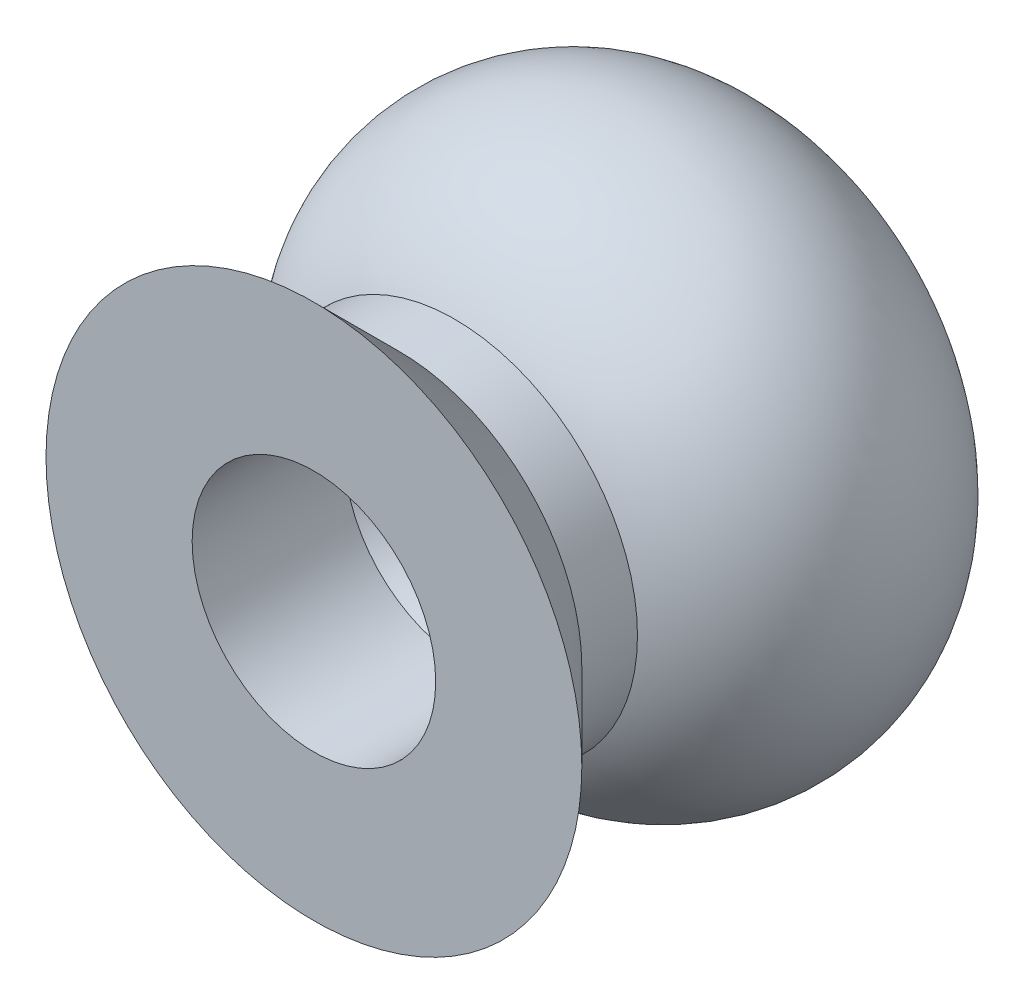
from build123d import *


with BuildPart() as part:
    # Skica1 → Oto_it kolem osy1 (revolve)
    with BuildSketch(Plane(origin=(0, 0, 0), x_dir=(0, 0, -1), z_dir=(1, 0, 0)), mode=Mode.PRIVATE) as oto_it_kolem_osy1_sk:
        with BuildLine():
            Line((0, 2), (0, 4.4))
            Line((0, 4.4), (1.4, 3))
            Line((1.4, 3), (2.313786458, 3))
            ThreePointArc((2.313786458, 3), (5.686060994, 4.584739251), (8, 1.66423924))
            Line((8, 1.66423924), (8, 1.65))
            Line((8, 1.65), (3.106217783, 1.65))
            Line((3.106217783, 1.65), (2.5, 2))
            Line((2.5, 2), (0, 2))
        make_face()
    revolve(oto_it_kolem_osy1_sk.sketch.rotate(Axis((0, 0, 0), (0, 0, -1)), 90), axis=Axis((0, 0, 0), (0, 0, -1)))


solid = part.part
